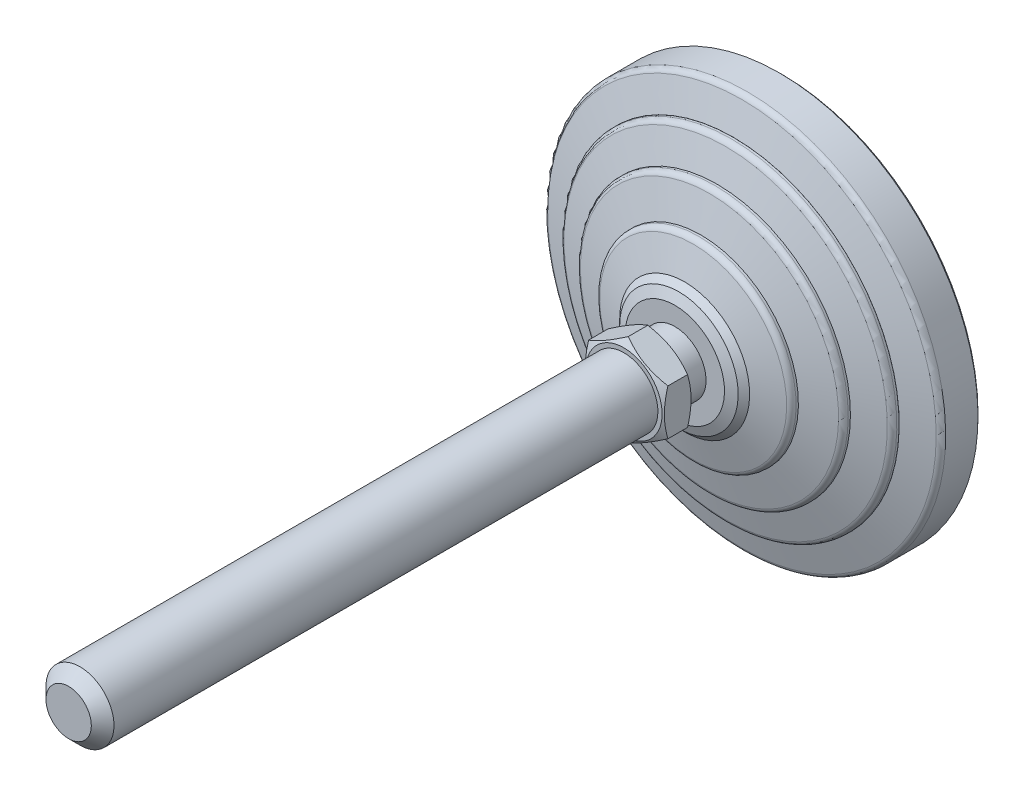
ISO-10303-21;
HEADER;
FILE_DESCRIPTION(('STEP AP214'),'2;1');
FILE_NAME('part.step','',(''),(''),'','','');
FILE_SCHEMA(('AUTOMOTIVE_DESIGN { 1 0 10303 214 1 1 1 1 }'));
ENDSEC;
DATA;
#1=APPLICATION_CONTEXT('core data for automotive mechanical design processes');
#2=APPLICATION_PROTOCOL_DEFINITION('international standard','automotive_design',2000,#1);
#3=PRODUCT_CONTEXT('',#1,'mechanical');
#4=PRODUCT('Part','Part','',(#3));
#5=PRODUCT_RELATED_PRODUCT_CATEGORY('part','',(#4));
#6=PRODUCT_DEFINITION_FORMATION('','',#4);
#7=PRODUCT_DEFINITION_CONTEXT('part definition',#1,'design');
#8=PRODUCT_DEFINITION('design','',#6,#7);
#9=PRODUCT_DEFINITION_SHAPE('','',#8);
#10=(LENGTH_UNIT() NAMED_UNIT(*) SI_UNIT(.MILLI.,.METRE.));
#11=(NAMED_UNIT(*) PLANE_ANGLE_UNIT() SI_UNIT($,.RADIAN.));
#12=(NAMED_UNIT(*) SI_UNIT($,.STERADIAN.) SOLID_ANGLE_UNIT());
#13=UNCERTAINTY_MEASURE_WITH_UNIT(LENGTH_MEASURE(1.E-05),#10,'distance_accuracy_value','');
#14=(GEOMETRIC_REPRESENTATION_CONTEXT(3) GLOBAL_UNCERTAINTY_ASSIGNED_CONTEXT((#13)) GLOBAL_UNIT_ASSIGNED_CONTEXT((#10,
#11,#12)) REPRESENTATION_CONTEXT('',''));
#15=CARTESIAN_POINT('',(0.,0.,0.));
#16=DIRECTION('',(0.,0.,1.));
#17=DIRECTION('',(1.,0.,0.));
#18=AXIS2_PLACEMENT_3D('',#15,#16,#17);
#19=CARTESIAN_POINT('',(-5.5,0.,23.));
#20=DIRECTION('',(0.,0.,1.));
#21=DIRECTION('',(0.,-1.,0.));
#22=AXIS2_PLACEMENT_3D('',#19,#20,#21);
#23=PLANE('',#22);
#24=CARTESIAN_POINT('',(0.,0.,23.));
#25=DIRECTION('',(0.,0.,-1.));
#26=DIRECTION('',(-1.,0.,0.));
#27=AXIS2_PLACEMENT_3D('',#24,#25,#26);
#28=CIRCLE('',#27,6.75);
#29=CARTESIAN_POINT('',(-6.75,0.,23.));
#30=VERTEX_POINT('',#29);
#31=EDGE_CURVE('E605',#30,#30,#28,.T.);
#32=ORIENTED_EDGE('',*,*,#31,.T.);
#33=EDGE_LOOP('',(#32));
#34=FACE_BOUND('',#33,.T.);
#35=CARTESIAN_POINT('',(0.,0.,23.));
#36=DIRECTION('',(0.,0.,-1.));
#37=DIRECTION('',(0.,1.,0.));
#38=AXIS2_PLACEMENT_3D('',#35,#36,#37);
#39=CIRCLE('',#38,5.5);
#40=CARTESIAN_POINT('',(0.,5.5,23.));
#41=VERTEX_POINT('',#40);
#42=EDGE_CURVE('E153',#41,#41,#39,.T.);
#43=ORIENTED_EDGE('',*,*,#42,.F.);
#44=EDGE_LOOP('',(#43));
#45=FACE_BOUND('',#44,.T.);
#46=ADVANCED_FACE('F14',(#34,#45),#23,.F.);
#47=CARTESIAN_POINT('',(0.,0.,0.));
#48=DIRECTION('',(0.,0.,-1.));
#49=DIRECTION('',(0.,1.,0.));
#50=AXIS2_PLACEMENT_3D('',#47,#48,#49);
#51=CYLINDRICAL_SURFACE('',#50,5.5);
#52=CARTESIAN_POINT('',(0.,0.,19.));
#53=DIRECTION('',(0.,0.,-1.));
#54=DIRECTION('',(0.,1.,0.));
#55=AXIS2_PLACEMENT_3D('',#52,#53,#54);
#56=CIRCLE('',#55,5.5);
#57=CARTESIAN_POINT('',(0.,5.5,19.));
#58=VERTEX_POINT('',#57);
#59=EDGE_CURVE('E150',#58,#58,#56,.T.);
#60=ORIENTED_EDGE('',*,*,#59,.F.);
#61=EDGE_LOOP('',(#60));
#62=FACE_BOUND('',#61,.T.);
#63=ORIENTED_EDGE('',*,*,#42,.T.);
#64=EDGE_LOOP('',(#63));
#65=FACE_BOUND('',#64,.T.);
#66=ADVANCED_FACE('F179',(#62,#65),#51,.T.);
#67=CARTESIAN_POINT('',(-8.7540983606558,0.,19.));
#68=DIRECTION('',(0.,0.,-1.));
#69=DIRECTION('',(0.,1.,0.));
#70=AXIS2_PLACEMENT_3D('',#67,#68,#69);
#71=PLANE('',#70);
#72=CARTESIAN_POINT('',(0.,0.,19.));
#73=DIRECTION('',(0.,0.,-1.));
#74=DIRECTION('',(0.,1.,0.));
#75=AXIS2_PLACEMENT_3D('',#72,#73,#74);
#76=CIRCLE('',#75,8.7540983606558);
#77=CARTESIAN_POINT('',(0.,8.7540983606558,19.));
#78=VERTEX_POINT('',#77);
#79=EDGE_CURVE('E147',#78,#78,#76,.T.);
#80=ORIENTED_EDGE('',*,*,#79,.F.);
#81=EDGE_LOOP('',(#80));
#82=FACE_BOUND('',#81,.T.);
#83=ORIENTED_EDGE('',*,*,#59,.T.);
#84=EDGE_LOOP('',(#83));
#85=FACE_BOUND('',#84,.T.);
#86=ADVANCED_FACE('F186',(#82,#85),#71,.F.);
#87=CARTESIAN_POINT('',(0.,0.,19.));
#88=DIRECTION('',(0.,0.,-1.));
#89=DIRECTION('',(0.,1.,0.));
#90=AXIS2_PLACEMENT_3D('',#87,#88,#89);
#91=CONICAL_SURFACE('',#90,8.7540983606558,1.17809724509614);
#92=CARTESIAN_POINT('',(0.,0.,18.2928932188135));
#93=DIRECTION('',(0.,0.,-1.));
#94=DIRECTION('',(0.,1.,0.));
#95=AXIS2_PLACEMENT_3D('',#92,#93,#94);
#96=CIRCLE('',#95,10.4612051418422);
#97=CARTESIAN_POINT('',(0.,10.4612051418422,18.2928932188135));
#98=VERTEX_POINT('',#97);
#99=EDGE_CURVE('E144',#98,#98,#96,.T.);
#100=ORIENTED_EDGE('',*,*,#99,.F.);
#101=EDGE_LOOP('',(#100));
#102=FACE_BOUND('',#101,.T.);
#103=ORIENTED_EDGE('',*,*,#79,.T.);
#104=EDGE_LOOP('',(#103));
#105=FACE_BOUND('',#104,.T.);
#106=ADVANCED_FACE('F433',(#102,#105),#91,.T.);
#107=CARTESIAN_POINT('',(0.,0.,18.2928932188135));
#108=DIRECTION('',(0.,0.,-1.));
#109=DIRECTION('',(0.,1.,0.));
#110=AXIS2_PLACEMENT_3D('',#107,#108,#109);
#111=CONICAL_SURFACE('',#110,10.4612051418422,0.785398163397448);
#112=CARTESIAN_POINT('',(0.,0.,17.2786885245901));
#113=DIRECTION('',(0.,0.,-1.));
#114=DIRECTION('',(0.,1.,0.));
#115=AXIS2_PLACEMENT_3D('',#112,#113,#114);
#116=CIRCLE('',#115,11.4754098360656);
#117=CARTESIAN_POINT('',(0.,11.4754098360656,17.2786885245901));
#118=VERTEX_POINT('',#117);
#119=EDGE_CURVE('E141',#118,#118,#116,.T.);
#120=ORIENTED_EDGE('',*,*,#119,.F.);
#121=EDGE_LOOP('',(#120));
#122=FACE_BOUND('',#121,.T.);
#123=ORIENTED_EDGE('',*,*,#99,.T.);
#124=EDGE_LOOP('',(#123));
#125=FACE_BOUND('',#124,.T.);
#126=ADVANCED_FACE('F423',(#122,#125),#111,.T.);
#127=CARTESIAN_POINT('',(0.,0.,17.2786885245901));
#128=DIRECTION('',(0.,0.,-1.));
#129=DIRECTION('',(0.,1.,0.));
#130=AXIS2_PLACEMENT_3D('',#127,#128,#129);
#131=CONICAL_SURFACE('',#130,11.4754098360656,1.27933953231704);
#132=CARTESIAN_POINT('',(0.,0.,15.7711726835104));
#133=DIRECTION('',(0.,0.,-1.));
#134=DIRECTION('',(0.,1.,0.));
#135=AXIS2_PLACEMENT_3D('',#132,#133,#134);
#136=CIRCLE('',#135,16.5004626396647);
#137=CARTESIAN_POINT('',(0.,16.5004626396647,15.7711726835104));
#138=VERTEX_POINT('',#137);
#139=EDGE_CURVE('E138',#138,#138,#136,.T.);
#140=ORIENTED_EDGE('',*,*,#139,.F.);
#141=EDGE_LOOP('',(#140));
#142=FACE_BOUND('',#141,.T.);
#143=ORIENTED_EDGE('',*,*,#119,.T.);
#144=EDGE_LOOP('',(#143));
#145=FACE_BOUND('',#144,.T.);
#146=ADVANCED_FACE('F413',(#142,#145),#131,.T.);
#147=CARTESIAN_POINT('',(0.,0.,14.8133463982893));
#148=DIRECTION('',(0.,0.,-1.));
#149=DIRECTION('',(0.,1.,0.));
#150=AXIS2_PLACEMENT_3D('',#147,#148,#149);
#151=TOROIDAL_SURFACE('',#150,16.2131147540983,1.);
#152=CARTESIAN_POINT('',(0.,0.,14.8133463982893));
#153=DIRECTION('',(0.,0.,-1.));
#154=DIRECTION('',(0.,1.,0.));
#155=AXIS2_PLACEMENT_3D('',#152,#153,#154);
#156=CIRCLE('',#155,17.2131147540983);
#157=CARTESIAN_POINT('',(0.,17.2131147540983,14.8133463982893));
#158=VERTEX_POINT('',#157);
#159=EDGE_CURVE('E135',#158,#158,#156,.T.);
#160=ORIENTED_EDGE('',*,*,#159,.F.);
#161=EDGE_LOOP('',(#160));
#162=FACE_BOUND('',#161,.T.);
#163=ORIENTED_EDGE('',*,*,#139,.T.);
#164=EDGE_LOOP('',(#163));
#165=FACE_BOUND('',#164,.T.);
#166=ADVANCED_FACE('F403',(#162,#165),#151,.T.);
#167=CARTESIAN_POINT('',(0.,0.,0.));
#168=DIRECTION('',(0.,0.,-1.));
#169=DIRECTION('',(0.,1.,0.));
#170=AXIS2_PLACEMENT_3D('',#167,#168,#169);
#171=CYLINDRICAL_SURFACE('',#170,17.2131147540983);
#172=CARTESIAN_POINT('',(0.,0.,14.4098360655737));
#173=DIRECTION('',(0.,0.,-1.));
#174=DIRECTION('',(0.,1.,0.));
#175=AXIS2_PLACEMENT_3D('',#172,#173,#174);
#176=CIRCLE('',#175,17.2131147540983);
#177=CARTESIAN_POINT('',(0.,17.2131147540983,14.4098360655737));
#178=VERTEX_POINT('',#177);
#179=EDGE_CURVE('E132',#178,#178,#176,.T.);
#180=ORIENTED_EDGE('',*,*,#179,.F.);
#181=EDGE_LOOP('',(#180));
#182=FACE_BOUND('',#181,.T.);
#183=ORIENTED_EDGE('',*,*,#159,.T.);
#184=EDGE_LOOP('',(#183));
#185=FACE_BOUND('',#184,.T.);
#186=ADVANCED_FACE('F393',(#182,#185),#171,.T.);
#187=CARTESIAN_POINT('',(0.,0.,14.4098360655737));
#188=DIRECTION('',(0.,0.,-1.));
#189=DIRECTION('',(0.,1.,0.));
#190=AXIS2_PLACEMENT_3D('',#187,#188,#189);
#191=CONICAL_SURFACE('',#190,17.2131147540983,1.30454427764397);
#192=CARTESIAN_POINT('',(0.,0.,12.8894925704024));
#193=DIRECTION('',(0.,0.,-1.));
#194=DIRECTION('',(0.,1.,0.));
#195=AXIS2_PLACEMENT_3D('',#192,#193,#194);
#196=CIRCLE('',#195,22.7877075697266);
#197=CARTESIAN_POINT('',(0.,22.7877075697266,12.8894925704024));
#198=VERTEX_POINT('',#197);
#199=EDGE_CURVE('E129',#198,#198,#196,.T.);
#200=ORIENTED_EDGE('',*,*,#199,.F.);
#201=EDGE_LOOP('',(#200));
#202=FACE_BOUND('',#201,.T.);
#203=ORIENTED_EDGE('',*,*,#179,.T.);
#204=EDGE_LOOP('',(#203));
#205=FACE_BOUND('',#204,.T.);
#206=ADVANCED_FACE('F383',(#202,#205),#191,.T.);
#207=CARTESIAN_POINT('',(0.,0.,11.9247287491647));
#208=DIRECTION('',(0.,0.,-1.));
#209=DIRECTION('',(0.,1.,0.));
#210=AXIS2_PLACEMENT_3D('',#207,#208,#209);
#211=TOROIDAL_SURFACE('',#210,22.5245901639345,1.);
#212=CARTESIAN_POINT('',(0.,0.,11.9247287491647));
#213=DIRECTION('',(0.,0.,-1.));
#214=DIRECTION('',(0.,1.,0.));
#215=AXIS2_PLACEMENT_3D('',#212,#213,#214);
#216=CIRCLE('',#215,23.5245901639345);
#217=CARTESIAN_POINT('',(0.,23.5245901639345,11.9247287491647));
#218=VERTEX_POINT('',#217);
#219=EDGE_CURVE('E126',#218,#218,#216,.T.);
#220=ORIENTED_EDGE('',*,*,#219,.F.);
#221=EDGE_LOOP('',(#220));
#222=FACE_BOUND('',#221,.T.);
#223=ORIENTED_EDGE('',*,*,#199,.T.);
#224=EDGE_LOOP('',(#223));
#225=FACE_BOUND('',#224,.T.);
#226=ADVANCED_FACE('F373',(#222,#225),#211,.T.);
#227=CARTESIAN_POINT('',(0.,0.,0.));
#228=DIRECTION('',(0.,0.,-1.));
#229=DIRECTION('',(0.,1.,0.));
#230=AXIS2_PLACEMENT_3D('',#227,#228,#229);
#231=CYLINDRICAL_SURFACE('',#230,23.5245901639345);
#232=CARTESIAN_POINT('',(0.,0.,11.5409836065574));
#233=DIRECTION('',(0.,0.,-1.));
#234=DIRECTION('',(0.,1.,0.));
#235=AXIS2_PLACEMENT_3D('',#232,#233,#234);
#236=CIRCLE('',#235,23.5245901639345);
#237=CARTESIAN_POINT('',(0.,23.5245901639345,11.5409836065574));
#238=VERTEX_POINT('',#237);
#239=EDGE_CURVE('E123',#238,#238,#236,.T.);
#240=ORIENTED_EDGE('',*,*,#239,.F.);
#241=EDGE_LOOP('',(#240));
#242=FACE_BOUND('',#241,.T.);
#243=ORIENTED_EDGE('',*,*,#219,.T.);
#244=EDGE_LOOP('',(#243));
#245=FACE_BOUND('',#244,.T.);
#246=ADVANCED_FACE('F363',(#242,#245),#231,.T.);
#247=CARTESIAN_POINT('',(0.,0.,11.5409836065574));
#248=DIRECTION('',(0.,0.,-1.));
#249=DIRECTION('',(0.,1.,0.));
#250=AXIS2_PLACEMENT_3D('',#247,#248,#249);
#251=CONICAL_SURFACE('',#250,23.5245901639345,1.27871257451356);
#252=CARTESIAN_POINT('',(0.,0.,10.0337743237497));
#253=DIRECTION('',(0.,0.,-1.));
#254=DIRECTION('',(0.,1.,0.));
#255=AXIS2_PLACEMENT_3D('',#252,#253,#254);
#256=CIRCLE('',#255,28.5372004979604);
#257=CARTESIAN_POINT('',(0.,28.5372004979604,10.0337743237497));
#258=VERTEX_POINT('',#257);
#259=EDGE_CURVE('E120',#258,#258,#256,.T.);
#260=ORIENTED_EDGE('',*,*,#259,.F.);
#261=EDGE_LOOP('',(#260));
#262=FACE_BOUND('',#261,.T.);
#263=ORIENTED_EDGE('',*,*,#239,.T.);
#264=EDGE_LOOP('',(#263));
#265=FACE_BOUND('',#264,.T.);
#266=ADVANCED_FACE('F353',(#262,#265),#251,.T.);
#267=CARTESIAN_POINT('',(0.,0.,9.07612838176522));
#268=DIRECTION('',(0.,0.,-1.));
#269=DIRECTION('',(0.,1.,0.));
#270=AXIS2_PLACEMENT_3D('',#267,#268,#269);
#271=TOROIDAL_SURFACE('',#270,28.2492521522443,0.999999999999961);
#272=CARTESIAN_POINT('',(0.,0.,9.07612838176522));
#273=DIRECTION('',(0.,0.,-1.));
#274=DIRECTION('',(0.,1.,0.));
#275=AXIS2_PLACEMENT_3D('',#272,#273,#274);
#276=CIRCLE('',#275,29.2492521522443);
#277=CARTESIAN_POINT('',(0.,29.2492521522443,9.07612838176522));
#278=VERTEX_POINT('',#277);
#279=EDGE_CURVE('E117',#278,#278,#276,.T.);
#280=ORIENTED_EDGE('',*,*,#279,.F.);
#281=EDGE_LOOP('',(#280));
#282=FACE_BOUND('',#281,.T.);
#283=ORIENTED_EDGE('',*,*,#259,.T.);
#284=EDGE_LOOP('',(#283));
#285=FACE_BOUND('',#284,.T.);
#286=ADVANCED_FACE('F343',(#282,#285),#271,.T.);
#287=CARTESIAN_POINT('',(0.,0.,0.));
#288=DIRECTION('',(0.,0.,-1.));
#289=DIRECTION('',(0.,1.,0.));
#290=AXIS2_PLACEMENT_3D('',#287,#288,#289);
#291=CYLINDRICAL_SURFACE('',#290,29.2492521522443);
#292=CARTESIAN_POINT('',(0.,0.,8.67213114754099));
#293=DIRECTION('',(0.,0.,-1.));
#294=DIRECTION('',(0.,1.,0.));
#295=AXIS2_PLACEMENT_3D('',#292,#293,#294);
#296=CIRCLE('',#295,29.2492521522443);
#297=CARTESIAN_POINT('',(0.,29.2492521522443,8.67213114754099));
#298=VERTEX_POINT('',#297);
#299=EDGE_CURVE('E114',#298,#298,#296,.T.);
#300=ORIENTED_EDGE('',*,*,#299,.F.);
#301=EDGE_LOOP('',(#300));
#302=FACE_BOUND('',#301,.T.);
#303=ORIENTED_EDGE('',*,*,#279,.T.);
#304=EDGE_LOOP('',(#303));
#305=FACE_BOUND('',#304,.T.);
#306=ADVANCED_FACE('F333',(#302,#305),#291,.T.);
#307=CARTESIAN_POINT('',(-29.2622950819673,0.,8.67213114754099));
#308=DIRECTION('',(0.,0.,-1.));
#309=DIRECTION('',(0.,1.,0.));
#310=AXIS2_PLACEMENT_3D('',#307,#308,#309);
#311=PLANE('',#310);
#312=CARTESIAN_POINT('',(0.,0.,8.67213114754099));
#313=DIRECTION('',(0.,0.,-1.));
#314=DIRECTION('',(0.,1.,0.));
#315=AXIS2_PLACEMENT_3D('',#312,#313,#314);
#316=CIRCLE('',#315,29.2622950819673);
#317=CARTESIAN_POINT('',(0.,29.2622950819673,8.67213114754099));
#318=VERTEX_POINT('',#317);
#319=EDGE_CURVE('E111',#318,#318,#316,.T.);
#320=ORIENTED_EDGE('',*,*,#319,.F.);
#321=EDGE_LOOP('',(#320));
#322=FACE_BOUND('',#321,.T.);
#323=ORIENTED_EDGE('',*,*,#299,.T.);
#324=EDGE_LOOP('',(#323));
#325=FACE_BOUND('',#324,.T.);
#326=ADVANCED_FACE('F323',(#322,#325),#311,.F.);
#327=CARTESIAN_POINT('',(0.,0.,8.67213114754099));
#328=DIRECTION('',(0.,0.,-1.));
#329=DIRECTION('',(0.,1.,0.));
#330=AXIS2_PLACEMENT_3D('',#327,#328,#329);
#331=CONICAL_SURFACE('',#330,29.2622950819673,1.27933953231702);
#332=CARTESIAN_POINT('',(0.,0.,7.1646153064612));
#333=DIRECTION('',(0.,0.,-1.));
#334=DIRECTION('',(0.,1.,0.));
#335=AXIS2_PLACEMENT_3D('',#332,#333,#334);
#336=CIRCLE('',#335,34.2873478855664);
#337=CARTESIAN_POINT('',(0.,34.2873478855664,7.1646153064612));
#338=VERTEX_POINT('',#337);
#339=EDGE_CURVE('E108',#338,#338,#336,.T.);
#340=ORIENTED_EDGE('',*,*,#339,.F.);
#341=EDGE_LOOP('',(#340));
#342=FACE_BOUND('',#341,.T.);
#343=ORIENTED_EDGE('',*,*,#319,.T.);
#344=EDGE_LOOP('',(#343));
#345=FACE_BOUND('',#344,.T.);
#346=ADVANCED_FACE('F313',(#342,#345),#331,.T.);
#347=CARTESIAN_POINT('',(0.,0.,6.20678902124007));
#348=DIRECTION('',(0.,0.,-1.));
#349=DIRECTION('',(0.,1.,0.));
#350=AXIS2_PLACEMENT_3D('',#347,#348,#349);
#351=TOROIDAL_SURFACE('',#350,34.,1.);
#352=CARTESIAN_POINT('',(0.,0.,6.20678902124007));
#353=DIRECTION('',(0.,0.,-1.));
#354=DIRECTION('',(0.,1.,0.));
#355=AXIS2_PLACEMENT_3D('',#352,#353,#354);
#356=CIRCLE('',#355,35.);
#357=CARTESIAN_POINT('',(0.,35.,6.20678902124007));
#358=VERTEX_POINT('',#357);
#359=EDGE_CURVE('E105',#358,#358,#356,.T.);
#360=ORIENTED_EDGE('',*,*,#359,.F.);
#361=EDGE_LOOP('',(#360));
#362=FACE_BOUND('',#361,.T.);
#363=ORIENTED_EDGE('',*,*,#339,.T.);
#364=EDGE_LOOP('',(#363));
#365=FACE_BOUND('',#364,.T.);
#366=ADVANCED_FACE('F303',(#362,#365),#351,.T.);
#367=CARTESIAN_POINT('',(0.,0.,0.));
#368=DIRECTION('',(0.,0.,-1.));
#369=DIRECTION('',(0.,1.,0.));
#370=AXIS2_PLACEMENT_3D('',#367,#368,#369);
#371=CYLINDRICAL_SURFACE('',#370,35.);
#372=CARTESIAN_POINT('',(0.,0.,0.5));
#373=DIRECTION('',(0.,0.,-1.));
#374=DIRECTION('',(0.,1.,0.));
#375=AXIS2_PLACEMENT_3D('',#372,#373,#374);
#376=CIRCLE('',#375,35.);
#377=CARTESIAN_POINT('',(0.,35.,0.5));
#378=VERTEX_POINT('',#377);
#379=EDGE_CURVE('E102',#378,#378,#376,.T.);
#380=ORIENTED_EDGE('',*,*,#379,.F.);
#381=EDGE_LOOP('',(#380));
#382=FACE_BOUND('',#381,.T.);
#383=ORIENTED_EDGE('',*,*,#359,.T.);
#384=EDGE_LOOP('',(#383));
#385=FACE_BOUND('',#384,.T.);
#386=ADVANCED_FACE('F293',(#382,#385),#371,.T.);
#387=CARTESIAN_POINT('',(0.,0.,0.5));
#388=DIRECTION('',(0.,0.,1.));
#389=DIRECTION('',(0.,-1.,0.));
#390=AXIS2_PLACEMENT_3D('',#387,#388,#389);
#391=CONICAL_SURFACE('',#390,35.,0.785398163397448);
#392=CARTESIAN_POINT('',(0.,0.,0.));
#393=DIRECTION('',(0.,0.,-1.));
#394=DIRECTION('',(0.,1.,0.));
#395=AXIS2_PLACEMENT_3D('',#392,#393,#394);
#396=CIRCLE('',#395,34.5);
#397=CARTESIAN_POINT('',(0.,34.5,0.));
#398=VERTEX_POINT('',#397);
#399=EDGE_CURVE('E99',#398,#398,#396,.T.);
#400=ORIENTED_EDGE('',*,*,#399,.F.);
#401=EDGE_LOOP('',(#400));
#402=FACE_BOUND('',#401,.T.);
#403=ORIENTED_EDGE('',*,*,#379,.T.);
#404=EDGE_LOOP('',(#403));
#405=FACE_BOUND('',#404,.T.);
#406=ADVANCED_FACE('F283',(#402,#405),#391,.T.);
#407=CARTESIAN_POINT('',(-34.5,0.,0.));
#408=DIRECTION('',(0.,0.,1.));
#409=DIRECTION('',(0.,-1.,0.));
#410=AXIS2_PLACEMENT_3D('',#407,#408,#409);
#411=PLANE('',#410);
#412=ORIENTED_EDGE('',*,*,#399,.T.);
#413=EDGE_LOOP('',(#412));
#414=FACE_BOUND('',#413,.T.);
#415=ADVANCED_FACE('F175',(#414),#411,.F.);
#416=CARTESIAN_POINT('',(0.,0.,24.7588890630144));
#417=DIRECTION('',(0.,0.,1.));
#418=DIRECTION('',(1.,0.,0.));
#419=AXIS2_PLACEMENT_3D('',#416,#417,#418);
#420=CONICAL_SURFACE('',#419,9.79648522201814,1.0471975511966);
#421=CARTESIAN_POINT('',(0.000200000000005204,-8.08301923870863,23.7696190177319));
#422=CARTESIAN_POINT('',(-0.153667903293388,-7.99418356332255,23.7183374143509));
#423=CARTESIAN_POINT('',(-0.308109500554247,-7.90501666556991,23.669383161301));
#424=CARTESIAN_POINT('',(-0.618246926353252,-7.72595873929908,23.5767703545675));
#425=CARTESIAN_POINT('',(-0.773943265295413,-7.63606741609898,23.5331140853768));
#426=CARTESIAN_POINT('',(-1.24352516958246,-7.36495417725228,23.4109491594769));
#427=CARTESIAN_POINT('',(-1.5592643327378,-7.18266208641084,23.3414631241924));
#428=CARTESIAN_POINT('',(-2.03176224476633,-6.90986528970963,23.2599825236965));
#429=CARTESIAN_POINT('',(-2.18710922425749,-6.82017566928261,23.2367710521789));
#430=CARTESIAN_POINT('',(-2.49850511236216,-6.64039116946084,23.1978487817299));
#431=CARTESIAN_POINT('',(-2.65455395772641,-6.55029632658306,23.1821373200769));
#432=CARTESIAN_POINT('',(-2.96692267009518,-6.36995016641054,23.1586154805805));
#433=CARTESIAN_POINT('',(-3.12324202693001,-6.27969914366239,23.1507961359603));
#434=CARTESIAN_POINT('',(-3.43601650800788,-6.09911871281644,23.1432178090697));
#435=CARTESIAN_POINT('',(-3.59247162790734,-6.00878930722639,23.1434585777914));
#436=CARTESIAN_POINT('',(-4.02110687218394,-5.76131663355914,23.155197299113));
#437=CARTESIAN_POINT('',(-4.2931466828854,-5.60425437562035,23.1749033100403));
#438=CARTESIAN_POINT('',(-4.8354194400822,-5.29117305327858,23.2373910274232));
#439=CARTESIAN_POINT('',(-5.10565047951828,-5.13515508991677,23.2801940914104));
#440=CARTESIAN_POINT('',(-5.64901454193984,-4.82144370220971,23.3871892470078));
#441=CARTESIAN_POINT('',(-5.92207900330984,-4.66378986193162,23.4518346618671));
#442=CARTESIAN_POINT('',(-6.46413578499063,-4.35083323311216,23.5985536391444));
#443=CARTESIAN_POINT('',(-6.73313504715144,-4.1955264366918,23.680592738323));
#444=CARTESIAN_POINT('',(-7.0002,-4.04133641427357,23.7696190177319));
#445=B_SPLINE_CURVE_WITH_KNOTS('',3,(#421,#422,#423,#424,#425,#426,#427,#428,#429,#430,#431,
#432,#433,#434,#435,#436,#437,#438,#439,#440,#441,#442,#443,#444),.UNSPECIFIED.,.F.,.F.,(4,2,2,
2,2,2,2,2,2,2,2,4),(0.,0.554727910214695,1.10969417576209,2.2219327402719,2.76443041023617,
3.30688013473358,3.84871284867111,4.3905288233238,5.33376515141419,6.27787517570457,
7.2429241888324,8.20607866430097),.UNSPECIFIED.);
#446=CARTESIAN_POINT('',(0.,-8.08290376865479,23.7695523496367));
#447=VERTEX_POINT('',#446);
#448=CARTESIAN_POINT('',(-7.,-4.04145188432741,23.7695523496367));
#449=VERTEX_POINT('',#448);
#450=EDGE_CURVE('E73',#447,#449,#445,.T.);
#451=ORIENTED_EDGE('',*,*,#450,.T.);
#452=CARTESIAN_POINT('',(-7.,-10.8361735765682,26.5509874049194));
#453=CARTESIAN_POINT('',(-7.,-10.530601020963,26.4028364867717));
#454=CARTESIAN_POINT('',(-7.,-10.2243248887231,26.2561118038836));
#455=CARTESIAN_POINT('',(-7.,-9.60999122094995,25.9663174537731));
#456=CARTESIAN_POINT('',(-7.,-9.3019334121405,25.8232483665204));
#457=CARTESIAN_POINT('',(-7.,-8.68206550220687,25.5408437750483));
#458=CARTESIAN_POINT('',(-7.,-8.37024409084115,25.4015330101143));
#459=CARTESIAN_POINT('',(-7.,-7.74411429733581,25.1286388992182));
#460=CARTESIAN_POINT('',(-7.,-7.42980603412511,24.9950552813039));
#461=CARTESIAN_POINT('',(-7.,-6.78813491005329,24.7309850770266));
#462=CARTESIAN_POINT('',(-7.,-6.46067513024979,24.6007326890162));
#463=CARTESIAN_POINT('',(-7.,-5.80191805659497,24.3501335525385));
#464=CARTESIAN_POINT('',(-7.,-5.4706203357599,24.2297879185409));
#465=CARTESIAN_POINT('',(-7.,-4.80428275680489,24.002176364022));
#466=CARTESIAN_POINT('',(-7.,-4.46925210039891,23.8948837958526));
#467=CARTESIAN_POINT('',(-7.,-3.79439715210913,23.6968327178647));
#468=CARTESIAN_POINT('',(-7.,-3.45457441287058,23.6060689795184));
#469=CARTESIAN_POINT('',(-7.,-2.77176726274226,23.4459318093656));
#470=CARTESIAN_POINT('',(-7.,-2.42881062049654,23.3764431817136));
#471=CARTESIAN_POINT('',(-7.,-1.91126836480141,23.2911849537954));
#472=CARTESIAN_POINT('',(-7.,-1.73822354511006,23.2659268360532));
#473=CARTESIAN_POINT('',(-7.,-1.39128048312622,23.2222313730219));
#474=CARTESIAN_POINT('',(-7.,-1.21738232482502,23.2037933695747));
#475=CARTESIAN_POINT('',(-7.,-0.8712287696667,23.1743357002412));
#476=CARTESIAN_POINT('',(-7.,-0.698981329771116,23.1632228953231));
#477=CARTESIAN_POINT('',(-7.,-0.354170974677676,23.1482898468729));
#478=CARTESIAN_POINT('',(-7.,-0.181608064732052,23.1444694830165));
#479=CARTESIAN_POINT('',(-7.,0.163525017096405,23.1442123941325));
#480=CARTESIAN_POINT('',(-7.,0.336095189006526,23.1477756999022));
#481=CARTESIAN_POINT('',(-7.,0.680932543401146,23.1621992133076));
#482=CARTESIAN_POINT('',(-7.,0.853199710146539,23.1730597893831));
#483=CARTESIAN_POINT('',(-7.,1.26780612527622,23.2077511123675));
#484=CARTESIAN_POINT('',(-7.,1.509859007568,23.2350772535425));
#485=CARTESIAN_POINT('',(-7.,1.99214394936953,23.3026411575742));
#486=CARTESIAN_POINT('',(-7.,2.23237575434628,23.3428806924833));
#487=CARTESIAN_POINT('',(-7.,2.95007846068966,23.4808335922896));
#488=CARTESIAN_POINT('',(-7.,3.42428404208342,23.5957554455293));
#489=CARTESIAN_POINT('',(-7.,4.13332418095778,23.7947371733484));
#490=CARTESIAN_POINT('',(-7.,4.37184408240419,23.8664175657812));
#491=CARTESIAN_POINT('',(-7.,4.84656666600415,24.0171479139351));
#492=CARTESIAN_POINT('',(-7.,5.08276933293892,24.0961979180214));
#493=CARTESIAN_POINT('',(-7.,5.55293322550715,24.260405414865));
#494=CARTESIAN_POINT('',(-7.,5.78689517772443,24.3455608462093));
#495=CARTESIAN_POINT('',(-7.,6.25288568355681,24.520984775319));
#496=CARTESIAN_POINT('',(-7.,6.48491425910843,24.6112532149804));
#497=CARTESIAN_POINT('',(-7.,7.02963502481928,24.8289810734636));
#498=CARTESIAN_POINT('',(-7.,7.34160997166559,24.958231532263));
#499=CARTESIAN_POINT('',(-7.,7.96293270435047,25.222917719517));
#500=CARTESIAN_POINT('',(-7.,8.27228033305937,25.358353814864));
#501=CARTESIAN_POINT('',(-7.,8.88882801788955,25.6341768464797));
#502=CARTESIAN_POINT('',(-7.,9.19602763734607,25.7745647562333));
#503=CARTESIAN_POINT('',(-7.,9.80858645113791,26.0593069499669));
#504=CARTESIAN_POINT('',(-7.,10.1139456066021,26.203661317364));
#505=CARTESIAN_POINT('',(-7.,10.7234370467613,26.4957467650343));
#506=CARTESIAN_POINT('',(-7.,11.0275677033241,26.6434812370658));
#507=CARTESIAN_POINT('',(-7.,11.6345239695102,26.9416095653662));
#508=CARTESIAN_POINT('',(-7.,11.9373495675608,27.0920034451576));
#509=CARTESIAN_POINT('',(-7.,12.8440999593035,27.546431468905));
#510=CARTESIAN_POINT('',(-7.,13.4463782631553,27.8537506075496));
#511=CARTESIAN_POINT('',(-7.,14.5978018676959,28.4487559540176));
#512=CARTESIAN_POINT('',(-7.,15.1472022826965,28.7359506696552));
#513=CARTESIAN_POINT('',(-7.,16.2439600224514,29.3142579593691));
#514=CARTESIAN_POINT('',(-7.,16.7913172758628,29.6053706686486));
#515=CARTESIAN_POINT('',(-7.,17.8830938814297,30.1898640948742));
#516=CARTESIAN_POINT('',(-7.,18.4275171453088,30.483237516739));
#517=CARTESIAN_POINT('',(-7.,19.5150558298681,31.0723293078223));
#518=CARTESIAN_POINT('',(-7.,20.0581713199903,31.3680475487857));
#519=CARTESIAN_POINT('',(-7.,20.6008047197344,31.6646418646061));
#520=B_SPLINE_CURVE_WITH_KNOTS('',3,(#452,#453,#454,#455,#456,#457,#458,#459,#460,#461,#462,
#463,#464,#465,#466,#467,#468,#469,#470,#471,#472,#473,#474,#475,#476,#477,#478,#479,#480,#481,
#482,#483,#484,#485,#486,#487,#488,#489,#490,#491,#492,#493,#494,#495,#496,#497,#498,#499,#500,
#501,#502,#503,#504,#505,#506,#507,#508,#509,#510,#511,#512,#513,#514,#515,#516,#517,#518,#519),
.UNSPECIFIED.,.F.,.F.,(4,2,2,2,2,2,2,2,2,2,2,2,2,2,2,2,2,2,2,2,2,2,2,2,2,2,2,2,2,2,2,2,2,4),(0.,
1.0187909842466,2.03774261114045,3.06227479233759,4.08675826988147,5.14387575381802,
6.20111199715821,7.25615234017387,8.31085836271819,9.35974825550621,9.88427042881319,
10.4087419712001,10.9264092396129,11.4440679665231,11.9617288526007,12.4794158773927,
13.2097741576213,13.94023270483,15.4019676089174,16.1490798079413,16.8961969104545,
17.6430629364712,18.389920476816,19.4028986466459,20.4159369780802,21.4291755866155,
22.4424355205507,23.4567611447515,24.4710957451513,26.4994987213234,28.3592922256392,
30.2191500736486,32.074455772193,33.9296606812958),.UNSPECIFIED.);
#521=CARTESIAN_POINT('',(-7.,4.04145188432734,23.7695523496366));
#522=VERTEX_POINT('',#521);
#523=EDGE_CURVE('E81',#449,#522,#520,.T.);
#524=ORIENTED_EDGE('',*,*,#523,.T.);
#525=CARTESIAN_POINT('',(-7.0002,4.0413364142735,23.7696190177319));
#526=CARTESIAN_POINT('',(-6.84633209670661,4.13017208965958,23.7183374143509));
#527=CARTESIAN_POINT('',(-6.69189049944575,4.21933898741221,23.669383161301));
#528=CARTESIAN_POINT('',(-6.38175307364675,4.39839691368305,23.5767703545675));
#529=CARTESIAN_POINT('',(-6.22605673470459,4.48828823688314,23.5331140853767));
#530=CARTESIAN_POINT('',(-5.75647483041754,4.75940147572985,23.4109491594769));
#531=CARTESIAN_POINT('',(-5.44073566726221,4.94169356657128,23.3414631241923));
#532=CARTESIAN_POINT('',(-4.96823775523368,5.21449036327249,23.2599825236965));
#533=CARTESIAN_POINT('',(-4.81289077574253,5.3041799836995,23.2367710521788));
#534=CARTESIAN_POINT('',(-4.50149488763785,5.48396448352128,23.1978487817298));
#535=CARTESIAN_POINT('',(-4.34544604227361,5.57405932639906,23.1821373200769));
#536=CARTESIAN_POINT('',(-4.03307732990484,5.75440548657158,23.1586154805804));
#537=CARTESIAN_POINT('',(-3.87675797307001,5.84465650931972,23.1507961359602));
#538=CARTESIAN_POINT('',(-3.56398349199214,6.02523694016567,23.1432178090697));
#539=CARTESIAN_POINT('',(-3.40752837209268,6.11556634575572,23.1434585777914));
#540=CARTESIAN_POINT('',(-2.97889312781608,6.36303901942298,23.155197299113));
#541=CARTESIAN_POINT('',(-2.70685331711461,6.52010127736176,23.1749033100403));
#542=CARTESIAN_POINT('',(-2.16458055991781,6.83318259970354,23.2373910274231));
#543=CARTESIAN_POINT('',(-1.89434952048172,6.98920056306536,23.2801940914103));
#544=CARTESIAN_POINT('',(-1.35098545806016,7.30291195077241,23.3871892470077));
#545=CARTESIAN_POINT('',(-1.07792099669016,7.4605657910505,23.451834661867));
#546=CARTESIAN_POINT('',(-0.535864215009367,7.77352241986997,23.5985536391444));
#547=CARTESIAN_POINT('',(-0.266864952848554,7.92882921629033,23.6805927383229));
#548=CARTESIAN_POINT('',(0.000200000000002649,8.08301923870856,23.7696190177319));
#549=B_SPLINE_CURVE_WITH_KNOTS('',3,(#525,#526,#527,#528,#529,#530,#531,#532,#533,#534,#535,
#536,#537,#538,#539,#540,#541,#542,#543,#544,#545,#546,#547,#548),.UNSPECIFIED.,.F.,.F.,(4,2,2,
2,2,2,2,2,2,2,2,4),(0.,0.554727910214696,1.10969417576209,2.22193274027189,2.76443041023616,
3.30688013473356,3.84871284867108,4.39052882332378,5.33376515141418,6.27787517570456,
7.24292418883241,8.20607866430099),.UNSPECIFIED.);
#550=CARTESIAN_POINT('',(0.,8.08290376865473,23.7695523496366));
#551=VERTEX_POINT('',#550);
#552=EDGE_CURVE('E560',#522,#551,#549,.T.);
#553=ORIENTED_EDGE('',*,*,#552,.T.);
#554=CARTESIAN_POINT('',(-0.000199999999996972,8.08301923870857,23.7696190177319));
#555=CARTESIAN_POINT('',(0.153667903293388,7.99418356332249,23.7183374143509));
#556=CARTESIAN_POINT('',(0.308109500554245,7.90501666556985,23.669383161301));
#557=CARTESIAN_POINT('',(0.618246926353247,7.72595873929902,23.5767703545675));
#558=CARTESIAN_POINT('',(0.773943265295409,7.63606741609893,23.5331140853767));
#559=CARTESIAN_POINT('',(1.24352516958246,7.36495417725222,23.4109491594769));
#560=CARTESIAN_POINT('',(1.55926433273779,7.18266208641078,23.3414631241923));
#561=CARTESIAN_POINT('',(2.03176224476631,6.90986528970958,23.2599825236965));
#562=CARTESIAN_POINT('',(2.18710922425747,6.82017566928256,23.2367710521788));
#563=CARTESIAN_POINT('',(2.49850511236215,6.64039116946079,23.1978487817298));
#564=CARTESIAN_POINT('',(2.65455395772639,6.55029632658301,23.1821373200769));
#565=CARTESIAN_POINT('',(2.96692267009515,6.36995016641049,23.1586154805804));
#566=CARTESIAN_POINT('',(3.12324202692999,6.27969914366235,23.1507961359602));
#567=CARTESIAN_POINT('',(3.43601650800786,6.0991187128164,23.1432178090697));
#568=CARTESIAN_POINT('',(3.59247162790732,6.00878930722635,23.1434585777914));
#569=CARTESIAN_POINT('',(4.02110687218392,5.76131663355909,23.155197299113));
#570=CARTESIAN_POINT('',(4.29314668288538,5.60425437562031,23.1749033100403));
#571=CARTESIAN_POINT('',(4.83541944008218,5.29117305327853,23.2373910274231));
#572=CARTESIAN_POINT('',(5.10565047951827,5.13515508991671,23.2801940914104));
#573=CARTESIAN_POINT('',(5.64901454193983,4.82144370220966,23.3871892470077));
#574=CARTESIAN_POINT('',(5.92207900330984,4.66378986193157,23.451834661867));
#575=CARTESIAN_POINT('',(6.46413578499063,4.3508332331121,23.5985536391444));
#576=CARTESIAN_POINT('',(6.73313504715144,4.19552643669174,23.6805927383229));
#577=CARTESIAN_POINT('',(7.0002,4.04133641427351,23.7696190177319));
#578=B_SPLINE_CURVE_WITH_KNOTS('',3,(#554,#555,#556,#557,#558,#559,#560,#561,#562,#563,#564,
#565,#566,#567,#568,#569,#570,#571,#572,#573,#574,#575,#576,#577),.UNSPECIFIED.,.F.,.F.,(4,2,2,
2,2,2,2,2,2,2,2,4),(0.,0.554727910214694,1.10969417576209,2.22193274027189,2.76443041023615,
3.30688013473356,3.84871284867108,4.39052882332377,5.33376515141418,6.27787517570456,
7.2429241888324,8.20607866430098),.UNSPECIFIED.);
#579=CARTESIAN_POINT('',(7.,4.04145188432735,23.7695523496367));
#580=VERTEX_POINT('',#579);
#581=EDGE_CURVE('E555',#551,#580,#578,.T.);
#582=ORIENTED_EDGE('',*,*,#581,.T.);
#583=CARTESIAN_POINT('',(7.,-10.8361735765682,26.5509874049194));
#584=CARTESIAN_POINT('',(7.,-10.530601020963,26.4028364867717));
#585=CARTESIAN_POINT('',(7.,-10.2243248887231,26.2561118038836));
#586=CARTESIAN_POINT('',(7.,-9.60999122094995,25.9663174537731));
#587=CARTESIAN_POINT('',(7.,-9.30193341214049,25.8232483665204));
#588=CARTESIAN_POINT('',(7.,-8.68206550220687,25.5408437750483));
#589=CARTESIAN_POINT('',(7.,-8.37024409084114,25.4015330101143));
#590=CARTESIAN_POINT('',(7.,-7.7441142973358,25.1286388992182));
#591=CARTESIAN_POINT('',(7.,-7.42980603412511,24.9950552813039));
#592=CARTESIAN_POINT('',(7.,-6.78813491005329,24.7309850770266));
#593=CARTESIAN_POINT('',(7.,-6.46067513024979,24.6007326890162));
#594=CARTESIAN_POINT('',(7.,-5.80191805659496,24.3501335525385));
#595=CARTESIAN_POINT('',(7.,-5.47062033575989,24.2297879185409));
#596=CARTESIAN_POINT('',(7.,-4.80428275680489,24.002176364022));
#597=CARTESIAN_POINT('',(7.,-4.46925210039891,23.8948837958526));
#598=CARTESIAN_POINT('',(7.,-3.79439715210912,23.6968327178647));
#599=CARTESIAN_POINT('',(7.,-3.45457441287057,23.6060689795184));
#600=CARTESIAN_POINT('',(7.,-2.77176726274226,23.4459318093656));
#601=CARTESIAN_POINT('',(7.,-2.42881062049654,23.3764431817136));
#602=CARTESIAN_POINT('',(7.,-1.91126836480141,23.2911849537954));
#603=CARTESIAN_POINT('',(7.,-1.73822354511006,23.2659268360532));
#604=CARTESIAN_POINT('',(7.,-1.39128048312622,23.2222313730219));
#605=CARTESIAN_POINT('',(7.,-1.21738232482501,23.2037933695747));
#606=CARTESIAN_POINT('',(7.,-0.871228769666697,23.1743357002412));
#607=CARTESIAN_POINT('',(7.,-0.698981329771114,23.1632228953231));
#608=CARTESIAN_POINT('',(7.,-0.354170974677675,23.1482898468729));
#609=CARTESIAN_POINT('',(7.,-0.181608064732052,23.1444694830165));
#610=CARTESIAN_POINT('',(7.,0.163525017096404,23.1442123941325));
#611=CARTESIAN_POINT('',(7.,0.336095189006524,23.1477756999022));
#612=CARTESIAN_POINT('',(7.,0.680932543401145,23.1621992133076));
#613=CARTESIAN_POINT('',(7.,0.853199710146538,23.1730597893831));
#614=CARTESIAN_POINT('',(7.,1.26780612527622,23.2077511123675));
#615=CARTESIAN_POINT('',(7.,1.509859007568,23.2350772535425));
#616=CARTESIAN_POINT('',(7.,1.99214394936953,23.3026411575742));
#617=CARTESIAN_POINT('',(7.,2.23237575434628,23.3428806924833));
#618=CARTESIAN_POINT('',(7.,2.95007846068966,23.4808335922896));
#619=CARTESIAN_POINT('',(7.,3.42428404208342,23.5957554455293));
#620=CARTESIAN_POINT('',(7.,4.13332418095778,23.7947371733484));
#621=CARTESIAN_POINT('',(7.,4.37184408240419,23.8664175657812));
#622=CARTESIAN_POINT('',(7.,4.84656666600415,24.0171479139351));
#623=CARTESIAN_POINT('',(7.,5.08276933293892,24.0961979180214));
#624=CARTESIAN_POINT('',(7.,5.55293322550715,24.260405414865));
#625=CARTESIAN_POINT('',(7.,5.78689517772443,24.3455608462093));
#626=CARTESIAN_POINT('',(7.,6.25288568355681,24.520984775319));
#627=CARTESIAN_POINT('',(7.,6.48491425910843,24.6112532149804));
#628=CARTESIAN_POINT('',(7.,7.02963502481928,24.8289810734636));
#629=CARTESIAN_POINT('',(7.,7.34160997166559,24.958231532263));
#630=CARTESIAN_POINT('',(7.,7.96293270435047,25.222917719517));
#631=CARTESIAN_POINT('',(7.,8.27228033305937,25.358353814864));
#632=CARTESIAN_POINT('',(7.,8.88882801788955,25.6341768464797));
#633=CARTESIAN_POINT('',(7.,9.19602763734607,25.7745647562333));
#634=CARTESIAN_POINT('',(7.,9.80858645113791,26.0593069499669));
#635=CARTESIAN_POINT('',(7.,10.1139456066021,26.203661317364));
#636=CARTESIAN_POINT('',(7.,10.7234370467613,26.4957467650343));
#637=CARTESIAN_POINT('',(7.,11.0275677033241,26.6434812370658));
#638=CARTESIAN_POINT('',(7.,11.6345239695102,26.9416095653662));
#639=CARTESIAN_POINT('',(7.,11.9373495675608,27.0920034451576));
#640=CARTESIAN_POINT('',(7.,12.8440999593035,27.546431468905));
#641=CARTESIAN_POINT('',(7.,13.4463782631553,27.8537506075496));
#642=CARTESIAN_POINT('',(7.,14.5978018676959,28.4487559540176));
#643=CARTESIAN_POINT('',(7.,15.1472022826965,28.7359506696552));
#644=CARTESIAN_POINT('',(7.,16.2439600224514,29.3142579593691));
#645=CARTESIAN_POINT('',(7.,16.7913172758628,29.6053706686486));
#646=CARTESIAN_POINT('',(7.,17.8830938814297,30.1898640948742));
#647=CARTESIAN_POINT('',(7.,18.4275171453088,30.483237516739));
#648=CARTESIAN_POINT('',(7.,19.5150558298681,31.0723293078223));
#649=CARTESIAN_POINT('',(7.,20.0581713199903,31.3680475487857));
#650=CARTESIAN_POINT('',(7.,20.6008047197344,31.6646418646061));
#651=B_SPLINE_CURVE_WITH_KNOTS('',3,(#583,#584,#585,#586,#587,#588,#589,#590,#591,#592,#593,
#594,#595,#596,#597,#598,#599,#600,#601,#602,#603,#604,#605,#606,#607,#608,#609,#610,#611,#612,
#613,#614,#615,#616,#617,#618,#619,#620,#621,#622,#623,#624,#625,#626,#627,#628,#629,#630,#631,
#632,#633,#634,#635,#636,#637,#638,#639,#640,#641,#642,#643,#644,#645,#646,#647,#648,#649,#650),
.UNSPECIFIED.,.F.,.F.,(4,2,2,2,2,2,2,2,2,2,2,2,2,2,2,2,2,2,2,2,2,2,2,2,2,2,2,2,2,2,2,2,2,4),(0.,
1.0187909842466,2.03774261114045,3.0622747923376,4.08675826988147,5.14387575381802,
6.20111199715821,7.25615234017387,8.3108583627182,9.35974825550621,9.88427042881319,
10.4087419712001,10.9264092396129,11.4440679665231,11.9617288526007,12.4794158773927,
13.2097741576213,13.94023270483,15.4019676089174,16.1490798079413,16.8961969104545,
17.6430629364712,18.389920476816,19.4028986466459,20.4159369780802,21.4291755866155,
22.4424355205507,23.4567611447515,24.4710957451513,26.4994987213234,28.3592922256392,
30.2191500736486,32.074455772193,33.9296606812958),.UNSPECIFIED.);
#652=CARTESIAN_POINT('',(7.,-4.04145188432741,23.7695523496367));
#653=VERTEX_POINT('',#652);
#654=EDGE_CURVE('E34',#580,#653,#651,.F.);
#655=ORIENTED_EDGE('',*,*,#654,.T.);
#656=CARTESIAN_POINT('',(7.0002,-4.04133641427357,23.7696190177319));
#657=CARTESIAN_POINT('',(6.84633209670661,-4.13017208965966,23.7183374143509));
#658=CARTESIAN_POINT('',(6.69189049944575,-4.21933898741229,23.669383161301));
#659=CARTESIAN_POINT('',(6.38175307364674,-4.39839691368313,23.5767703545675));
#660=CARTESIAN_POINT('',(6.22605673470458,-4.48828823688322,23.5331140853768));
#661=CARTESIAN_POINT('',(5.75647483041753,-4.75940147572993,23.4109491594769));
#662=CARTESIAN_POINT('',(5.4407356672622,-4.94169356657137,23.3414631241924));
#663=CARTESIAN_POINT('',(4.96823775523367,-5.21449036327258,23.2599825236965));
#664=CARTESIAN_POINT('',(4.81289077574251,-5.30417998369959,23.2367710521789));
#665=CARTESIAN_POINT('',(4.50149488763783,-5.48396448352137,23.1978487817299));
#666=CARTESIAN_POINT('',(4.34544604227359,-5.57405932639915,23.1821373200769));
#667=CARTESIAN_POINT('',(4.03307732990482,-5.75440548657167,23.1586154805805));
#668=CARTESIAN_POINT('',(3.87675797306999,-5.84465650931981,23.1507961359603));
#669=CARTESIAN_POINT('',(3.56398349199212,-6.02523694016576,23.1432178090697));
#670=CARTESIAN_POINT('',(3.40752837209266,-6.11556634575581,23.1434585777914));
#671=CARTESIAN_POINT('',(2.97889312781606,-6.36303901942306,23.155197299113));
#672=CARTESIAN_POINT('',(2.7068533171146,-6.52010127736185,23.1749033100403));
#673=CARTESIAN_POINT('',(2.1645805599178,-6.83318259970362,23.2373910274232));
#674=CARTESIAN_POINT('',(1.89434952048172,-6.98920056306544,23.2801940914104));
#675=CARTESIAN_POINT('',(1.35098545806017,-7.30291195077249,23.3871892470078));
#676=CARTESIAN_POINT('',(1.07792099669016,-7.46056579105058,23.4518346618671));
#677=CARTESIAN_POINT('',(0.535864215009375,-7.77352241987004,23.5985536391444));
#678=CARTESIAN_POINT('',(0.266864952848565,-7.9288292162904,23.680592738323));
#679=CARTESIAN_POINT('',(-0.000199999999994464,-8.08301923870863,23.7696190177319));
#680=B_SPLINE_CURVE_WITH_KNOTS('',3,(#656,#657,#658,#659,#660,#661,#662,#663,#664,#665,#666,
#667,#668,#669,#670,#671,#672,#673,#674,#675,#676,#677,#678,#679),.UNSPECIFIED.,.F.,.F.,(4,2,2,
2,2,2,2,2,2,2,2,4),(0.,0.554727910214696,1.10969417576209,2.2219327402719,2.76443041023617,
3.30688013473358,3.8487128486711,4.3905288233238,5.33376515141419,6.27787517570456,
7.24292418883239,8.20607866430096),.UNSPECIFIED.);
#681=EDGE_CURVE('E9',#653,#447,#680,.T.);
#682=ORIENTED_EDGE('',*,*,#681,.T.);
#683=EDGE_LOOP('',(#451,#524,#553,#582,#655,#682));
#684=FACE_BOUND('',#683,.T.);
#685=ORIENTED_EDGE('',*,*,#31,.F.);
#686=EDGE_LOOP('',(#685));
#687=FACE_BOUND('',#686,.T.);
#688=ADVANCED_FACE('F71',(#684,#687),#420,.T.);
#689=CARTESIAN_POINT('',(-3.99999999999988,0.,126.));
#690=DIRECTION('',(0.,0.,-1.));
#691=DIRECTION('',(0.,1.,0.));
#692=AXIS2_PLACEMENT_3D('',#689,#690,#691);
#693=PLANE('',#692);
#694=CARTESIAN_POINT('',(0.,0.,126.));
#695=DIRECTION('',(0.,0.,-1.));
#696=DIRECTION('',(0.,1.,0.));
#697=AXIS2_PLACEMENT_3D('',#694,#695,#696);
#698=CIRCLE('',#697,3.99999999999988);
#699=CARTESIAN_POINT('',(0.,3.99999999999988,126.));
#700=VERTEX_POINT('',#699);
#701=EDGE_CURVE('E96',#700,#700,#698,.T.);
#702=ORIENTED_EDGE('',*,*,#701,.F.);
#703=EDGE_LOOP('',(#702));
#704=FACE_BOUND('',#703,.T.);
#705=ADVANCED_FACE('F165',(#704),#693,.F.);
#706=CARTESIAN_POINT('',(0.,0.,126.));
#707=DIRECTION('',(0.,0.,-1.));
#708=DIRECTION('',(0.,1.,0.));
#709=AXIS2_PLACEMENT_3D('',#706,#707,#708);
#710=CONICAL_SURFACE('',#709,3.99999999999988,0.785398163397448);
#711=CARTESIAN_POINT('',(0.,0.,124.));
#712=DIRECTION('',(0.,0.,-1.));
#713=DIRECTION('',(0.,1.,0.));
#714=AXIS2_PLACEMENT_3D('',#711,#712,#713);
#715=CIRCLE('',#714,5.99999999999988);
#716=CARTESIAN_POINT('',(0.,5.99999999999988,124.));
#717=VERTEX_POINT('',#716);
#718=EDGE_CURVE('E28',#717,#717,#715,.T.);
#719=ORIENTED_EDGE('',*,*,#718,.F.);
#720=EDGE_LOOP('',(#719));
#721=FACE_BOUND('',#720,.T.);
#722=ORIENTED_EDGE('',*,*,#701,.T.);
#723=EDGE_LOOP('',(#722));
#724=FACE_BOUND('',#723,.T.);
#725=ADVANCED_FACE('F16',(#721,#724),#710,.T.);
#726=CARTESIAN_POINT('',(0.,0.,0.));
#727=DIRECTION('',(0.,0.,-1.));
#728=DIRECTION('',(0.,1.,0.));
#729=AXIS2_PLACEMENT_3D('',#726,#727,#728);
#730=CYLINDRICAL_SURFACE('',#729,5.99999999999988);
#731=CARTESIAN_POINT('',(0.,0.,28.));
#732=DIRECTION('',(0.,0.,-1.));
#733=DIRECTION('',(0.,1.,0.));
#734=AXIS2_PLACEMENT_3D('',#731,#732,#733);
#735=CIRCLE('',#734,5.99999999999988);
#736=CARTESIAN_POINT('',(0.,5.99999999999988,28.));
#737=VERTEX_POINT('',#736);
#738=EDGE_CURVE('E156',#737,#737,#735,.T.);
#739=ORIENTED_EDGE('',*,*,#738,.F.);
#740=EDGE_LOOP('',(#739));
#741=FACE_BOUND('',#740,.T.);
#742=ORIENTED_EDGE('',*,*,#718,.T.);
#743=EDGE_LOOP('',(#742));
#744=FACE_BOUND('',#743,.T.);
#745=ADVANCED_FACE('F161',(#741,#744),#730,.T.);
#746=CARTESIAN_POINT('',(-5.99999999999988,0.,28.));
#747=DIRECTION('',(0.,0.,-1.));
#748=DIRECTION('',(0.,1.,0.));
#749=AXIS2_PLACEMENT_3D('',#746,#747,#748);
#750=PLANE('',#749);
#751=CARTESIAN_POINT('',(0.,0.,28.));
#752=DIRECTION('',(0.,0.,-1.));
#753=DIRECTION('',(-1.,0.,0.));
#754=AXIS2_PLACEMENT_3D('',#751,#752,#753);
#755=CIRCLE('',#754,6.75);
#756=CARTESIAN_POINT('',(-6.75,0.,28.));
#757=VERTEX_POINT('',#756);
#758=EDGE_CURVE('E80',#757,#757,#755,.T.);
#759=ORIENTED_EDGE('',*,*,#758,.F.);
#760=EDGE_LOOP('',(#759));
#761=FACE_BOUND('',#760,.T.);
#762=ORIENTED_EDGE('',*,*,#738,.T.);
#763=EDGE_LOOP('',(#762));
#764=FACE_BOUND('',#763,.T.);
#765=ADVANCED_FACE('F193',(#761,#764),#750,.F.);
#766=CARTESIAN_POINT('',(0.,0.,28.));
#767=DIRECTION('',(0.,0.,-1.));
#768=DIRECTION('',(-1.,0.,0.));
#769=AXIS2_PLACEMENT_3D('',#766,#767,#768);
#770=CONICAL_SURFACE('',#769,6.75,1.0471975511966);
#771=CARTESIAN_POINT('',(-7.0002,-4.04133641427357,27.2303809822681));
#772=CARTESIAN_POINT('',(-6.84633209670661,-4.13017208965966,27.2816625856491));
#773=CARTESIAN_POINT('',(-6.69189049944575,-4.21933898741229,27.330616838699));
#774=CARTESIAN_POINT('',(-6.38175307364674,-4.39839691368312,27.4232296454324));
#775=CARTESIAN_POINT('',(-6.22605673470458,-4.48828823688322,27.4668859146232));
#776=CARTESIAN_POINT('',(-5.75647483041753,-4.75940147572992,27.5890508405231));
#777=CARTESIAN_POINT('',(-5.4407356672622,-4.94169356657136,27.6585368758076));
#778=CARTESIAN_POINT('',(-4.96823775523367,-5.21449036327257,27.7400174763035));
#779=CARTESIAN_POINT('',(-4.81289077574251,-5.30417998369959,27.7632289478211));
#780=CARTESIAN_POINT('',(-4.50149488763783,-5.48396448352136,27.8021512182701));
#781=CARTESIAN_POINT('',(-4.34544604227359,-5.57405932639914,27.8178626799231));
#782=CARTESIAN_POINT('',(-4.03307732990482,-5.75440548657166,27.8413845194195));
#783=CARTESIAN_POINT('',(-3.87675797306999,-5.8446565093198,27.8492038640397));
#784=CARTESIAN_POINT('',(-3.56398349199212,-6.02523694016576,27.8567821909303));
#785=CARTESIAN_POINT('',(-3.40752837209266,-6.11556634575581,27.8565414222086));
#786=CARTESIAN_POINT('',(-2.97889312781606,-6.36303901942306,27.844802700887));
#787=CARTESIAN_POINT('',(-2.7068533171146,-6.52010127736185,27.8250966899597));
#788=CARTESIAN_POINT('',(-2.1645805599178,-6.83318259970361,27.7626089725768));
#789=CARTESIAN_POINT('',(-1.89434952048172,-6.98920056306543,27.7198059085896));
#790=CARTESIAN_POINT('',(-1.35098545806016,-7.30291195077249,27.6128107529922));
#791=CARTESIAN_POINT('',(-1.07792099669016,-7.46056579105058,27.5481653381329));
#792=CARTESIAN_POINT('',(-0.535864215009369,-7.77352241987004,27.4014463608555));
#793=CARTESIAN_POINT('',(-0.266864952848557,-7.9288292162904,27.319407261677));
#794=CARTESIAN_POINT('',(0.000200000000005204,-8.08301923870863,27.2303809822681));
#795=B_SPLINE_CURVE_WITH_KNOTS('',3,(#771,#772,#773,#774,#775,#776,#777,#778,#779,#780,#781,
#782,#783,#784,#785,#786,#787,#788,#789,#790,#791,#792,#793,#794),.UNSPECIFIED.,.F.,.F.,(4,2,2,
2,2,2,2,2,2,2,2,4),(0.,0.554727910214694,1.10969417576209,2.2219327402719,2.76443041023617,
3.30688013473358,3.8487128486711,4.39052882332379,5.33376515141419,6.27787517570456,
7.2429241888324,8.20607866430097),.UNSPECIFIED.);
#796=CARTESIAN_POINT('',(-7.,-4.04145188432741,27.2304476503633));
#797=VERTEX_POINT('',#796);
#798=CARTESIAN_POINT('',(0.,-8.08290376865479,27.2304476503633));
#799=VERTEX_POINT('',#798);
#800=EDGE_CURVE('E88',#797,#799,#795,.T.);
#801=ORIENTED_EDGE('',*,*,#800,.T.);
#802=CARTESIAN_POINT('',(-0.000199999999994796,-8.08301923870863,27.2303809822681));
#803=CARTESIAN_POINT('',(0.1536679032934,-7.99418356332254,27.2816625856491));
#804=CARTESIAN_POINT('',(0.30810950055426,-7.90501666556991,27.330616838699));
#805=CARTESIAN_POINT('',(0.618246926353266,-7.72595873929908,27.4232296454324));
#806=CARTESIAN_POINT('',(0.773943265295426,-7.63606741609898,27.4668859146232));
#807=CARTESIAN_POINT('',(1.24352516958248,-7.36495417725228,27.5890508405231));
#808=CARTESIAN_POINT('',(1.55926433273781,-7.18266208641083,27.6585368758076));
#809=CARTESIAN_POINT('',(2.03176224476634,-6.90986528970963,27.7400174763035));
#810=CARTESIAN_POINT('',(2.1871092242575,-6.82017566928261,27.7632289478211));
#811=CARTESIAN_POINT('',(2.49850511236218,-6.64039116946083,27.8021512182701));
#812=CARTESIAN_POINT('',(2.65455395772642,-6.55029632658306,27.817862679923));
#813=CARTESIAN_POINT('',(2.96692267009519,-6.36995016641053,27.8413845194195));
#814=CARTESIAN_POINT('',(3.12324202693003,-6.27969914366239,27.8492038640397));
#815=CARTESIAN_POINT('',(3.43601650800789,-6.09911871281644,27.8567821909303));
#816=CARTESIAN_POINT('',(3.59247162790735,-6.00878930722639,27.8565414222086));
#817=CARTESIAN_POINT('',(4.02110687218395,-5.76131663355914,27.844802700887));
#818=CARTESIAN_POINT('',(4.29314668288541,-5.60425437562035,27.8250966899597));
#819=CARTESIAN_POINT('',(4.8354194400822,-5.29117305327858,27.7626089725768));
#820=CARTESIAN_POINT('',(5.10565047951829,-5.13515508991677,27.7198059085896));
#821=CARTESIAN_POINT('',(5.64901454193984,-4.82144370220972,27.6128107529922));
#822=CARTESIAN_POINT('',(5.92207900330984,-4.66378986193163,27.5481653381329));
#823=CARTESIAN_POINT('',(6.46413578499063,-4.35083323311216,27.4014463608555));
#824=CARTESIAN_POINT('',(6.73313504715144,-4.19552643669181,27.319407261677));
#825=CARTESIAN_POINT('',(7.0002,-4.04133641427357,27.2303809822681));
#826=B_SPLINE_CURVE_WITH_KNOTS('',3,(#802,#803,#804,#805,#806,#807,#808,#809,#810,#811,#812,
#813,#814,#815,#816,#817,#818,#819,#820,#821,#822,#823,#824,#825),.UNSPECIFIED.,.F.,.F.,(4,2,2,
2,2,2,2,2,2,2,2,4),(0.,0.554727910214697,1.10969417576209,2.2219327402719,2.76443041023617,
3.30688013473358,3.84871284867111,4.3905288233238,5.33376515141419,6.27787517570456,
7.24292418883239,8.20607866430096),.UNSPECIFIED.);
#827=CARTESIAN_POINT('',(7.,-4.04145188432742,27.2304476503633));
#828=VERTEX_POINT('',#827);
#829=EDGE_CURVE('E86',#799,#828,#826,.T.);
#830=ORIENTED_EDGE('',*,*,#829,.T.);
#831=CARTESIAN_POINT('',(7.,-10.8361735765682,24.4490125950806));
#832=CARTESIAN_POINT('',(7.,-10.530601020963,24.5971635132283));
#833=CARTESIAN_POINT('',(7.,-10.2243248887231,24.7438881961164));
#834=CARTESIAN_POINT('',(7.,-9.60999122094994,25.0336825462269));
#835=CARTESIAN_POINT('',(7.,-9.30193341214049,25.1767516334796));
#836=CARTESIAN_POINT('',(7.,-8.68206550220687,25.4591562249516));
#837=CARTESIAN_POINT('',(7.,-8.37024409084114,25.5984669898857));
#838=CARTESIAN_POINT('',(7.,-7.74411429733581,25.8713611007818));
#839=CARTESIAN_POINT('',(7.,-7.42980603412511,26.004944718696));
#840=CARTESIAN_POINT('',(7.,-6.78813491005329,26.2690149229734));
#841=CARTESIAN_POINT('',(7.,-6.46067513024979,26.3992673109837));
#842=CARTESIAN_POINT('',(7.,-5.80191805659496,26.6498664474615));
#843=CARTESIAN_POINT('',(7.,-5.47062033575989,26.7702120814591));
#844=CARTESIAN_POINT('',(7.,-4.80428275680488,26.9978236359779));
#845=CARTESIAN_POINT('',(7.,-4.4692521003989,27.1051162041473));
#846=CARTESIAN_POINT('',(7.,-3.79439715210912,27.3031672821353));
#847=CARTESIAN_POINT('',(7.,-3.45457441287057,27.3939310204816));
#848=CARTESIAN_POINT('',(7.,-2.77176726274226,27.5540681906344));
#849=CARTESIAN_POINT('',(7.,-2.42881062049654,27.6235568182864));
#850=CARTESIAN_POINT('',(7.,-1.9112683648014,27.7088150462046));
#851=CARTESIAN_POINT('',(7.,-1.73822354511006,27.7340731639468));
#852=CARTESIAN_POINT('',(7.,-1.39128048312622,27.7777686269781));
#853=CARTESIAN_POINT('',(7.,-1.21738232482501,27.7962066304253));
#854=CARTESIAN_POINT('',(7.,-0.871228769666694,27.8256642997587));
#855=CARTESIAN_POINT('',(7.,-0.698981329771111,27.8367771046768));
#856=CARTESIAN_POINT('',(7.,-0.354170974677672,27.8517101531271));
#857=CARTESIAN_POINT('',(7.,-0.181608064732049,27.8555305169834));
#858=CARTESIAN_POINT('',(7.,0.163525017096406,27.8557876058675));
#859=CARTESIAN_POINT('',(7.,0.336095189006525,27.8522243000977));
#860=CARTESIAN_POINT('',(7.,0.680932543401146,27.8378007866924));
#861=CARTESIAN_POINT('',(7.,0.85319971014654,27.8269402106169));
#862=CARTESIAN_POINT('',(7.,1.26780612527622,27.7922488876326));
#863=CARTESIAN_POINT('',(7.,1.50985900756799,27.7649227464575));
#864=CARTESIAN_POINT('',(7.,1.99214394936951,27.6973588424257));
#865=CARTESIAN_POINT('',(7.,2.23237575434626,27.6571193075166));
#866=CARTESIAN_POINT('',(7.,2.95007846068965,27.5191664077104));
#867=CARTESIAN_POINT('',(7.,3.4242840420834,27.4042445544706));
#868=CARTESIAN_POINT('',(7.,4.13332418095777,27.2052628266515));
#869=CARTESIAN_POINT('',(7.,4.37184408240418,27.1335824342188));
#870=CARTESIAN_POINT('',(7.,4.84656666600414,26.9828520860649));
#871=CARTESIAN_POINT('',(7.,5.0827693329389,26.9038020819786));
#872=CARTESIAN_POINT('',(7.,5.55293322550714,26.739594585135));
#873=CARTESIAN_POINT('',(7.,5.78689517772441,26.6544391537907));
#874=CARTESIAN_POINT('',(7.,6.2528856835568,26.4790152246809));
#875=CARTESIAN_POINT('',(7.,6.48491425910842,26.3887467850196));
#876=CARTESIAN_POINT('',(7.,7.02963502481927,26.1710189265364));
#877=CARTESIAN_POINT('',(7.,7.34160997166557,26.041768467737));
#878=CARTESIAN_POINT('',(7.,7.96293270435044,25.777082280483));
#879=CARTESIAN_POINT('',(7.,8.27228033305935,25.641646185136));
#880=CARTESIAN_POINT('',(7.,8.88882801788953,25.3658231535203));
#881=CARTESIAN_POINT('',(7.,9.19602763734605,25.2254352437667));
#882=CARTESIAN_POINT('',(7.,9.80858645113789,24.9406930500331));
#883=CARTESIAN_POINT('',(7.,10.1139456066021,24.796338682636));
#884=CARTESIAN_POINT('',(7.,10.7234370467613,24.5042532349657));
#885=CARTESIAN_POINT('',(7.,11.0275677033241,24.3565187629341));
#886=CARTESIAN_POINT('',(7.,11.6345239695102,24.0583904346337));
#887=CARTESIAN_POINT('',(7.,11.9373495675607,23.9079965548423));
#888=CARTESIAN_POINT('',(7.,12.8440999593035,23.4535685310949));
#889=CARTESIAN_POINT('',(7.,13.4463782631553,23.1462493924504));
#890=CARTESIAN_POINT('',(7.,14.5978018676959,22.5512440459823));
#891=CARTESIAN_POINT('',(7.,15.1472022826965,22.2640493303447));
#892=CARTESIAN_POINT('',(7.,16.2439600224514,21.6857420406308));
#893=CARTESIAN_POINT('',(7.,16.7913172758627,21.3946293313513));
#894=CARTESIAN_POINT('',(7.,17.8830938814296,20.8101359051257));
#895=CARTESIAN_POINT('',(7.,18.4275171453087,20.5167624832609));
#896=CARTESIAN_POINT('',(7.,19.5150558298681,19.9276706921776));
#897=CARTESIAN_POINT('',(7.,20.0581713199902,19.6319524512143));
#898=CARTESIAN_POINT('',(7.,20.6008047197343,19.3353581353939));
#899=B_SPLINE_CURVE_WITH_KNOTS('',3,(#831,#832,#833,#834,#835,#836,#837,#838,#839,#840,#841,
#842,#843,#844,#845,#846,#847,#848,#849,#850,#851,#852,#853,#854,#855,#856,#857,#858,#859,#860,
#861,#862,#863,#864,#865,#866,#867,#868,#869,#870,#871,#872,#873,#874,#875,#876,#877,#878,#879,
#880,#881,#882,#883,#884,#885,#886,#887,#888,#889,#890,#891,#892,#893,#894,#895,#896,#897,#898),
.UNSPECIFIED.,.F.,.F.,(4,2,2,2,2,2,2,2,2,2,2,2,2,2,2,2,2,2,2,2,2,2,2,2,2,2,2,2,2,2,2,2,2,4),(0.,
1.01879098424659,2.03774261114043,3.06227479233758,4.08675826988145,5.14387575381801,
6.2011119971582,7.25615234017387,8.31085836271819,9.35974825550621,9.88427042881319,
10.4087419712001,10.9264092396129,11.4440679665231,11.9617288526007,12.4794158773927,
13.2097741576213,13.94023270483,15.4019676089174,16.1490798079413,16.8961969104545,
17.6430629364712,18.389920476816,19.4028986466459,20.4159369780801,21.4291755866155,
22.4424355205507,23.4567611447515,24.4710957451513,26.4994987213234,28.3592922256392,
30.2191500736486,32.074455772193,33.9296606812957),.UNSPECIFIED.);
#900=CARTESIAN_POINT('',(7.,4.04145188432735,27.2304476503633));
#901=VERTEX_POINT('',#900);
#902=EDGE_CURVE('E600',#828,#901,#899,.T.);
#903=ORIENTED_EDGE('',*,*,#902,.T.);
#904=CARTESIAN_POINT('',(7.0002,4.04133641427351,27.2303809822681));
#905=CARTESIAN_POINT('',(6.84633209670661,4.13017208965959,27.2816625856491));
#906=CARTESIAN_POINT('',(6.69189049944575,4.21933898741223,27.330616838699));
#907=CARTESIAN_POINT('',(6.38175307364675,4.39839691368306,27.4232296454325));
#908=CARTESIAN_POINT('',(6.22605673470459,4.48828823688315,27.4668859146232));
#909=CARTESIAN_POINT('',(5.75647483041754,4.75940147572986,27.5890508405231));
#910=CARTESIAN_POINT('',(5.4407356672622,4.9416935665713,27.6585368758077));
#911=CARTESIAN_POINT('',(4.96823775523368,5.2144903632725,27.7400174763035));
#912=CARTESIAN_POINT('',(4.81289077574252,5.30417998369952,27.7632289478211));
#913=CARTESIAN_POINT('',(4.50149488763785,5.4839644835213,27.8021512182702));
#914=CARTESIAN_POINT('',(4.3454460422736,5.57405932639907,27.8178626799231));
#915=CARTESIAN_POINT('',(4.03307732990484,5.7544054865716,27.8413845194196));
#916=CARTESIAN_POINT('',(3.87675797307,5.84465650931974,27.8492038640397));
#917=CARTESIAN_POINT('',(3.56398349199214,6.02523694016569,27.8567821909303));
#918=CARTESIAN_POINT('',(3.40752837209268,6.11556634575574,27.8565414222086));
#919=CARTESIAN_POINT('',(2.97889312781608,6.363039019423,27.844802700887));
#920=CARTESIAN_POINT('',(2.70685331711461,6.52010127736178,27.8250966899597));
#921=CARTESIAN_POINT('',(2.16458055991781,6.83318259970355,27.7626089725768));
#922=CARTESIAN_POINT('',(1.89434952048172,6.98920056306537,27.7198059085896));
#923=CARTESIAN_POINT('',(1.35098545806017,7.30291195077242,27.6128107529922));
#924=CARTESIAN_POINT('',(1.07792099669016,7.46056579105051,27.5481653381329));
#925=CARTESIAN_POINT('',(0.535864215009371,7.77352241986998,27.4014463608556));
#926=CARTESIAN_POINT('',(0.26686495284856,7.92882921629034,27.319407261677));
#927=CARTESIAN_POINT('',(-0.000199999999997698,8.08301923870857,27.2303809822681));
#928=B_SPLINE_CURVE_WITH_KNOTS('',3,(#904,#905,#906,#907,#908,#909,#910,#911,#912,#913,#914,
#915,#916,#917,#918,#919,#920,#921,#922,#923,#924,#925,#926,#927),.UNSPECIFIED.,.F.,.F.,(4,2,2,
2,2,2,2,2,2,2,2,4),(0.,0.554727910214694,1.10969417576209,2.22193274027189,2.76443041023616,
3.30688013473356,3.84871284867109,4.39052882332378,5.33376515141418,6.27787517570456,
7.2429241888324,8.20607866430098),.UNSPECIFIED.);
#929=CARTESIAN_POINT('',(0.,8.08290376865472,27.2304476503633));
#930=VERTEX_POINT('',#929);
#931=EDGE_CURVE('E577',#901,#930,#928,.T.);
#932=ORIENTED_EDGE('',*,*,#931,.T.);
#933=CARTESIAN_POINT('',(0.000200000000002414,8.08301923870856,27.2303809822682));
#934=CARTESIAN_POINT('',(-0.153667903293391,7.99418356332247,27.2816625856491));
#935=CARTESIAN_POINT('',(-0.30810950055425,7.90501666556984,27.330616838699));
#936=CARTESIAN_POINT('',(-0.618246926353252,7.72595873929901,27.4232296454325));
#937=CARTESIAN_POINT('',(-0.773943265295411,7.63606741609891,27.4668859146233));
#938=CARTESIAN_POINT('',(-1.24352516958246,7.36495417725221,27.5890508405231));
#939=CARTESIAN_POINT('',(-1.55926433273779,7.18266208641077,27.6585368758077));
#940=CARTESIAN_POINT('',(-2.03176224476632,6.90986528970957,27.7400174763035));
#941=CARTESIAN_POINT('',(-2.18710922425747,6.82017566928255,27.7632289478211));
#942=CARTESIAN_POINT('',(-2.49850511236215,6.64039116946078,27.8021512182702));
#943=CARTESIAN_POINT('',(-2.65455395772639,6.550296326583,27.8178626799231));
#944=CARTESIAN_POINT('',(-2.96692267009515,6.36995016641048,27.8413845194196));
#945=CARTESIAN_POINT('',(-3.12324202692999,6.27969914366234,27.8492038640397));
#946=CARTESIAN_POINT('',(-3.43601650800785,6.09911871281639,27.8567821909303));
#947=CARTESIAN_POINT('',(-3.59247162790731,6.00878930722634,27.8565414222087));
#948=CARTESIAN_POINT('',(-4.02110687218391,5.76131663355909,27.844802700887));
#949=CARTESIAN_POINT('',(-4.29314668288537,5.6042543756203,27.8250966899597));
#950=CARTESIAN_POINT('',(-4.83541944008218,5.29117305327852,27.7626089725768));
#951=CARTESIAN_POINT('',(-5.10565047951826,5.13515508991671,27.7198059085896));
#952=CARTESIAN_POINT('',(-5.64901454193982,4.82144370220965,27.6128107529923));
#953=CARTESIAN_POINT('',(-5.92207900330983,4.66378986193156,27.5481653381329));
#954=CARTESIAN_POINT('',(-6.46413578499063,4.35083323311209,27.4014463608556));
#955=CARTESIAN_POINT('',(-6.73313504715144,4.19552643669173,27.319407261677));
#956=CARTESIAN_POINT('',(-7.0002,4.0413364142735,27.2303809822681));
#957=B_SPLINE_CURVE_WITH_KNOTS('',3,(#933,#934,#935,#936,#937,#938,#939,#940,#941,#942,#943,
#944,#945,#946,#947,#948,#949,#950,#951,#952,#953,#954,#955,#956),.UNSPECIFIED.,.F.,.F.,(4,2,2,
2,2,2,2,2,2,2,2,4),(0.,0.554727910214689,1.10969417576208,2.22193274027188,2.76443041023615,
3.30688013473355,3.84871284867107,4.39052882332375,5.33376515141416,6.27787517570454,
7.24292418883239,8.20607866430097),.UNSPECIFIED.);
#958=CARTESIAN_POINT('',(-7.,4.04145188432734,27.2304476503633));
#959=VERTEX_POINT('',#958);
#960=EDGE_CURVE('E570',#930,#959,#957,.T.);
#961=ORIENTED_EDGE('',*,*,#960,.T.);
#962=CARTESIAN_POINT('',(-7.,-10.8361735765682,24.4490125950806));
#963=CARTESIAN_POINT('',(-7.,-10.530601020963,24.5971635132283));
#964=CARTESIAN_POINT('',(-7.,-10.2243248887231,24.7438881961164));
#965=CARTESIAN_POINT('',(-7.,-9.60999122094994,25.0336825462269));
#966=CARTESIAN_POINT('',(-7.,-9.30193341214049,25.1767516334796));
#967=CARTESIAN_POINT('',(-7.,-8.68206550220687,25.4591562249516));
#968=CARTESIAN_POINT('',(-7.,-8.37024409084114,25.5984669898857));
#969=CARTESIAN_POINT('',(-7.,-7.74411429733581,25.8713611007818));
#970=CARTESIAN_POINT('',(-7.,-7.42980603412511,26.004944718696));
#971=CARTESIAN_POINT('',(-7.,-6.78813491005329,26.2690149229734));
#972=CARTESIAN_POINT('',(-7.,-6.46067513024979,26.3992673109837));
#973=CARTESIAN_POINT('',(-7.,-5.80191805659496,26.6498664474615));
#974=CARTESIAN_POINT('',(-7.,-5.47062033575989,26.7702120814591));
#975=CARTESIAN_POINT('',(-7.,-4.80428275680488,26.9978236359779));
#976=CARTESIAN_POINT('',(-7.,-4.4692521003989,27.1051162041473));
#977=CARTESIAN_POINT('',(-7.,-3.79439715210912,27.3031672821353));
#978=CARTESIAN_POINT('',(-7.,-3.45457441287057,27.3939310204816));
#979=CARTESIAN_POINT('',(-7.,-2.77176726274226,27.5540681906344));
#980=CARTESIAN_POINT('',(-7.,-2.42881062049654,27.6235568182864));
#981=CARTESIAN_POINT('',(-7.,-1.9112683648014,27.7088150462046));
#982=CARTESIAN_POINT('',(-7.,-1.73822354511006,27.7340731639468));
#983=CARTESIAN_POINT('',(-7.,-1.39128048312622,27.7777686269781));
#984=CARTESIAN_POINT('',(-7.,-1.21738232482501,27.7962066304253));
#985=CARTESIAN_POINT('',(-7.,-0.871228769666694,27.8256642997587));
#986=CARTESIAN_POINT('',(-7.,-0.698981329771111,27.8367771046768));
#987=CARTESIAN_POINT('',(-7.,-0.354170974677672,27.8517101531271));
#988=CARTESIAN_POINT('',(-7.,-0.181608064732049,27.8555305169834));
#989=CARTESIAN_POINT('',(-7.,0.163525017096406,27.8557876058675));
#990=CARTESIAN_POINT('',(-7.,0.336095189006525,27.8522243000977));
#991=CARTESIAN_POINT('',(-7.,0.680932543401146,27.8378007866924));
#992=CARTESIAN_POINT('',(-7.,0.85319971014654,27.8269402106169));
#993=CARTESIAN_POINT('',(-7.,1.26780612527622,27.7922488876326));
#994=CARTESIAN_POINT('',(-7.,1.50985900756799,27.7649227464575));
#995=CARTESIAN_POINT('',(-7.,1.99214394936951,27.6973588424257));
#996=CARTESIAN_POINT('',(-7.,2.23237575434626,27.6571193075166));
#997=CARTESIAN_POINT('',(-7.,2.95007846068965,27.5191664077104));
#998=CARTESIAN_POINT('',(-7.,3.4242840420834,27.4042445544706));
#999=CARTESIAN_POINT('',(-7.,4.13332418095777,27.2052628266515));
#1000=CARTESIAN_POINT('',(-7.,4.37184408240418,27.1335824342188));
#1001=CARTESIAN_POINT('',(-7.,4.84656666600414,26.9828520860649));
#1002=CARTESIAN_POINT('',(-7.,5.0827693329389,26.9038020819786));
#1003=CARTESIAN_POINT('',(-7.,5.55293322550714,26.739594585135));
#1004=CARTESIAN_POINT('',(-7.,5.78689517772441,26.6544391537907));
#1005=CARTESIAN_POINT('',(-7.,6.2528856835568,26.4790152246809));
#1006=CARTESIAN_POINT('',(-7.,6.48491425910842,26.3887467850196));
#1007=CARTESIAN_POINT('',(-7.,7.02963502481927,26.1710189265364));
#1008=CARTESIAN_POINT('',(-7.,7.34160997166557,26.041768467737));
#1009=CARTESIAN_POINT('',(-7.,7.96293270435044,25.777082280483));
#1010=CARTESIAN_POINT('',(-7.,8.27228033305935,25.641646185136));
#1011=CARTESIAN_POINT('',(-7.,8.88882801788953,25.3658231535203));
#1012=CARTESIAN_POINT('',(-7.,9.19602763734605,25.2254352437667));
#1013=CARTESIAN_POINT('',(-7.,9.80858645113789,24.9406930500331));
#1014=CARTESIAN_POINT('',(-7.,10.1139456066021,24.796338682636));
#1015=CARTESIAN_POINT('',(-7.,10.7234370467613,24.5042532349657));
#1016=CARTESIAN_POINT('',(-7.,11.0275677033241,24.3565187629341));
#1017=CARTESIAN_POINT('',(-7.,11.6345239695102,24.0583904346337));
#1018=CARTESIAN_POINT('',(-7.,11.9373495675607,23.9079965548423));
#1019=CARTESIAN_POINT('',(-7.,12.8440999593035,23.4535685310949));
#1020=CARTESIAN_POINT('',(-7.,13.4463782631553,23.1462493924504));
#1021=CARTESIAN_POINT('',(-7.,14.5978018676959,22.5512440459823));
#1022=CARTESIAN_POINT('',(-7.,15.1472022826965,22.2640493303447));
#1023=CARTESIAN_POINT('',(-7.,16.2439600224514,21.6857420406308));
#1024=CARTESIAN_POINT('',(-7.,16.7913172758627,21.3946293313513));
#1025=CARTESIAN_POINT('',(-7.,17.8830938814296,20.8101359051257));
#1026=CARTESIAN_POINT('',(-7.,18.4275171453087,20.5167624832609));
#1027=CARTESIAN_POINT('',(-7.,19.5150558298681,19.9276706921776));
#1028=CARTESIAN_POINT('',(-7.,20.0581713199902,19.6319524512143));
#1029=CARTESIAN_POINT('',(-7.,20.6008047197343,19.3353581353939));
#1030=B_SPLINE_CURVE_WITH_KNOTS('',3,(#962,#963,#964,#965,#966,#967,#968,#969,#970,#971,#972,
#973,#974,#975,#976,#977,#978,#979,#980,#981,#982,#983,#984,#985,#986,#987,#988,#989,#990,#991,
#992,#993,#994,#995,#996,#997,#998,#999,#1000,#1001,#1002,#1003,#1004,#1005,#1006,#1007,#1008,
#1009,#1010,#1011,#1012,#1013,#1014,#1015,#1016,#1017,#1018,#1019,#1020,#1021,#1022,#1023,#1024,
#1025,#1026,#1027,#1028,#1029),.UNSPECIFIED.,.F.,.F.,(4,2,2,2,2,2,2,2,2,2,2,2,2,2,2,2,2,2,2,2,2,
2,2,2,2,2,2,2,2,2,2,2,2,4),(0.,1.01879098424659,2.03774261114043,3.06227479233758,
4.08675826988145,5.14387575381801,6.2011119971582,7.25615234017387,8.31085836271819,
9.35974825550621,9.88427042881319,10.4087419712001,10.9264092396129,11.4440679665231,
11.9617288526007,12.4794158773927,13.2097741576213,13.94023270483,15.4019676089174,
16.1490798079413,16.8961969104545,17.6430629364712,18.389920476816,19.4028986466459,
20.4159369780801,21.4291755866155,22.4424355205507,23.4567611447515,24.4710957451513,
26.4994987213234,28.3592922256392,30.2191500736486,32.074455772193,33.9296606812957),.UNSPECIFIED.);
#1031=EDGE_CURVE('E92',#959,#797,#1030,.F.);
#1032=ORIENTED_EDGE('',*,*,#1031,.T.);
#1033=EDGE_LOOP('',(#801,#830,#903,#932,#961,#1032));
#1034=FACE_BOUND('',#1033,.T.);
#1035=ORIENTED_EDGE('',*,*,#758,.T.);
#1036=EDGE_LOOP('',(#1035));
#1037=FACE_BOUND('',#1036,.T.);
#1038=ADVANCED_FACE('F195',(#1034,#1037),#770,.T.);
#1039=CARTESIAN_POINT('',(0.,-8.08290376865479,23.));
#1040=DIRECTION('',(0.5,-0.866025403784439,0.));
#1041=DIRECTION('',(0.866025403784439,0.5,0.));
#1042=AXIS2_PLACEMENT_3D('',#1039,#1040,#1041);
#1043=PLANE('',#1042);
#1044=ORIENTED_EDGE('',*,*,#681,.F.);
#1045=DIRECTION('',(0.,0.,1.));
#1046=VECTOR('',#1045,1.);
#1047=CARTESIAN_POINT('',(7.,-4.04145188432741,23.));
#1048=LINE('',#1047,#1046);
#1049=EDGE_CURVE('E87',#653,#828,#1048,.T.);
#1050=ORIENTED_EDGE('',*,*,#1049,.T.);
#1051=ORIENTED_EDGE('',*,*,#829,.F.);
#1052=DIRECTION('',(0.,0.,1.));
#1053=VECTOR('',#1052,1.);
#1054=CARTESIAN_POINT('',(0.,-8.08290376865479,23.));
#1055=LINE('',#1054,#1053);
#1056=EDGE_CURVE('E42',#447,#799,#1055,.T.);
#1057=ORIENTED_EDGE('',*,*,#1056,.F.);
#1058=EDGE_LOOP('',(#1044,#1050,#1051,#1057));
#1059=FACE_BOUND('',#1058,.T.);
#1060=ADVANCED_FACE('F84',(#1059),#1043,.T.);
#1061=CARTESIAN_POINT('',(7.,-4.04145188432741,23.));
#1062=DIRECTION('',(1.,0.,0.));
#1063=DIRECTION('',(0.,1.,0.));
#1064=AXIS2_PLACEMENT_3D('',#1061,#1062,#1063);
#1065=PLANE('',#1064);
#1066=ORIENTED_EDGE('',*,*,#654,.F.);
#1067=DIRECTION('',(0.,0.,1.));
#1068=VECTOR('',#1067,1.);
#1069=CARTESIAN_POINT('',(7.,4.04145188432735,23.));
#1070=LINE('',#1069,#1068);
#1071=EDGE_CURVE('E90',#580,#901,#1070,.T.);
#1072=ORIENTED_EDGE('',*,*,#1071,.T.);
#1073=ORIENTED_EDGE('',*,*,#902,.F.);
#1074=ORIENTED_EDGE('',*,*,#1049,.F.);
#1075=EDGE_LOOP('',(#1066,#1072,#1073,#1074));
#1076=FACE_BOUND('',#1075,.T.);
#1077=ADVANCED_FACE('F231',(#1076),#1065,.T.);
#1078=CARTESIAN_POINT('',(7.,4.04145188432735,23.));
#1079=DIRECTION('',(0.5,0.866025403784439,0.));
#1080=DIRECTION('',(-0.866025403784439,0.5,0.));
#1081=AXIS2_PLACEMENT_3D('',#1078,#1079,#1080);
#1082=PLANE('',#1081);
#1083=ORIENTED_EDGE('',*,*,#581,.F.);
#1084=DIRECTION('',(0.,0.,1.));
#1085=VECTOR('',#1084,1.);
#1086=CARTESIAN_POINT('',(0.,8.08290376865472,23.));
#1087=LINE('',#1086,#1085);
#1088=EDGE_CURVE('E594',#551,#930,#1087,.T.);
#1089=ORIENTED_EDGE('',*,*,#1088,.T.);
#1090=ORIENTED_EDGE('',*,*,#931,.F.);
#1091=ORIENTED_EDGE('',*,*,#1071,.F.);
#1092=EDGE_LOOP('',(#1083,#1089,#1090,#1091));
#1093=FACE_BOUND('',#1092,.T.);
#1094=ADVANCED_FACE('F238',(#1093),#1082,.T.);
#1095=CARTESIAN_POINT('',(0.,8.08290376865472,23.));
#1096=DIRECTION('',(-0.5,0.866025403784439,0.));
#1097=DIRECTION('',(-0.866025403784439,-0.5,0.));
#1098=AXIS2_PLACEMENT_3D('',#1095,#1096,#1097);
#1099=PLANE('',#1098);
#1100=ORIENTED_EDGE('',*,*,#552,.F.);
#1101=DIRECTION('',(0.,0.,1.));
#1102=VECTOR('',#1101,1.);
#1103=CARTESIAN_POINT('',(-7.,4.04145188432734,23.));
#1104=LINE('',#1103,#1102);
#1105=EDGE_CURVE('E593',#522,#959,#1104,.T.);
#1106=ORIENTED_EDGE('',*,*,#1105,.T.);
#1107=ORIENTED_EDGE('',*,*,#960,.F.);
#1108=ORIENTED_EDGE('',*,*,#1088,.F.);
#1109=EDGE_LOOP('',(#1100,#1106,#1107,#1108));
#1110=FACE_BOUND('',#1109,.T.);
#1111=ADVANCED_FACE('F247',(#1110),#1099,.T.);
#1112=CARTESIAN_POINT('',(-7.,4.04145188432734,23.));
#1113=DIRECTION('',(-1.,0.,0.));
#1114=DIRECTION('',(0.,-1.,0.));
#1115=AXIS2_PLACEMENT_3D('',#1112,#1113,#1114);
#1116=PLANE('',#1115);
#1117=ORIENTED_EDGE('',*,*,#523,.F.);
#1118=DIRECTION('',(0.,0.,1.));
#1119=VECTOR('',#1118,1.);
#1120=CARTESIAN_POINT('',(-7.,-4.04145188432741,23.));
#1121=LINE('',#1120,#1119);
#1122=EDGE_CURVE('E79',#449,#797,#1121,.T.);
#1123=ORIENTED_EDGE('',*,*,#1122,.T.);
#1124=ORIENTED_EDGE('',*,*,#1031,.F.);
#1125=ORIENTED_EDGE('',*,*,#1105,.F.);
#1126=EDGE_LOOP('',(#1117,#1123,#1124,#1125));
#1127=FACE_BOUND('',#1126,.T.);
#1128=ADVANCED_FACE('F256',(#1127),#1116,.T.);
#1129=CARTESIAN_POINT('',(-7.,-4.04145188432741,23.));
#1130=DIRECTION('',(-0.5,-0.866025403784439,0.));
#1131=DIRECTION('',(0.866025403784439,-0.5,0.));
#1132=AXIS2_PLACEMENT_3D('',#1129,#1130,#1131);
#1133=PLANE('',#1132);
#1134=ORIENTED_EDGE('',*,*,#450,.F.);
#1135=ORIENTED_EDGE('',*,*,#1056,.T.);
#1136=ORIENTED_EDGE('',*,*,#800,.F.);
#1137=ORIENTED_EDGE('',*,*,#1122,.F.);
#1138=EDGE_LOOP('',(#1134,#1135,#1136,#1137));
#1139=FACE_BOUND('',#1138,.T.);
#1140=ADVANCED_FACE('F78',(#1139),#1133,.T.);
#1141=CLOSED_SHELL('',(#46,#66,#86,#106,#126,#146,#166,#186,#206,#226,#246,#266,#286,#306,#326,
#346,#366,#386,#406,#415,#688,#705,#725,#745,#765,#1038,#1060,#1077,#1094,#1111,#1128,#1140));
#1142=MANIFOLD_SOLID_BREP('B1',#1141);
#1143=ADVANCED_BREP_SHAPE_REPRESENTATION('',(#18,#1142),#14);
#1144=SHAPE_DEFINITION_REPRESENTATION(#9,#1143);
ENDSEC;
END-ISO-10303-21;
